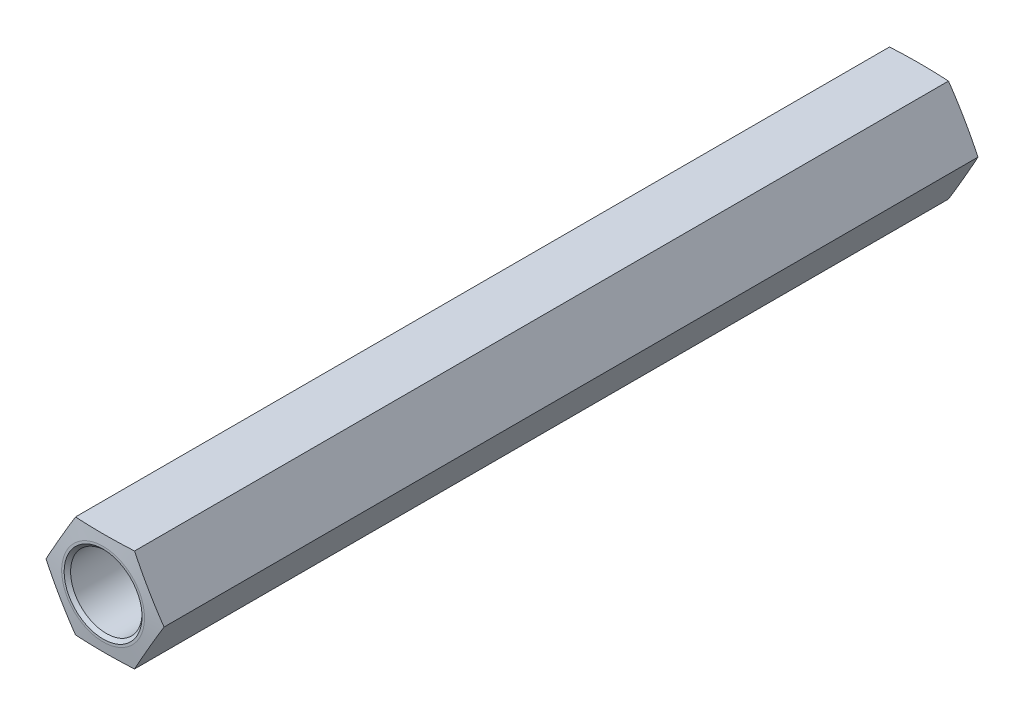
ISO-10303-21;
HEADER;
FILE_DESCRIPTION(('STEP AP214'),'2;1');
FILE_NAME('part.step','',(''),(''),'','','');
FILE_SCHEMA(('AUTOMOTIVE_DESIGN { 1 0 10303 214 1 1 1 1 }'));
ENDSEC;
DATA;
#1=APPLICATION_CONTEXT('core data for automotive mechanical design processes');
#2=APPLICATION_PROTOCOL_DEFINITION('international standard','automotive_design',2000,#1);
#3=PRODUCT_CONTEXT('',#1,'mechanical');
#4=PRODUCT('Part','Part','',(#3));
#5=PRODUCT_RELATED_PRODUCT_CATEGORY('part','',(#4));
#6=PRODUCT_DEFINITION_FORMATION('','',#4);
#7=PRODUCT_DEFINITION_CONTEXT('part definition',#1,'design');
#8=PRODUCT_DEFINITION('design','',#6,#7);
#9=PRODUCT_DEFINITION_SHAPE('','',#8);
#10=(LENGTH_UNIT() NAMED_UNIT(*) SI_UNIT(.MILLI.,.METRE.));
#11=(NAMED_UNIT(*) PLANE_ANGLE_UNIT() SI_UNIT($,.RADIAN.));
#12=(NAMED_UNIT(*) SI_UNIT($,.STERADIAN.) SOLID_ANGLE_UNIT());
#13=UNCERTAINTY_MEASURE_WITH_UNIT(LENGTH_MEASURE(1.E-05),#10,'distance_accuracy_value','');
#14=(GEOMETRIC_REPRESENTATION_CONTEXT(3) GLOBAL_UNCERTAINTY_ASSIGNED_CONTEXT((#13)) GLOBAL_UNIT_ASSIGNED_CONTEXT((#10,
#11,#12)) REPRESENTATION_CONTEXT('',''));
#15=CARTESIAN_POINT('',(0.,0.,0.));
#16=DIRECTION('',(0.,0.,1.));
#17=DIRECTION('',(1.,0.,0.));
#18=AXIS2_PLACEMENT_3D('',#15,#16,#17);
#19=CARTESIAN_POINT('',(3.6427233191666E-08,6.34999999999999,25.4));
#20=DIRECTION('',(0.,0.,-1.));
#21=DIRECTION('',(-1.,0.,0.));
#22=AXIS2_PLACEMENT_3D('',#19,#20,#21);
#23=PLANE('',#22);
#24=CARTESIAN_POINT('',(0.,-6.30938595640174E-08,25.4));
#25=DIRECTION('',(0.,0.,1.));
#26=DIRECTION('',(1.,0.,0.));
#27=AXIS2_PLACEMENT_3D('',#24,#25,#26);
#28=CIRCLE('',#27,2.57273925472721);
#29=CARTESIAN_POINT('',(2.57273925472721,-6.30938595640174E-08,25.4));
#30=VERTEX_POINT('',#29);
#31=EDGE_CURVE('E102',#30,#30,#28,.T.);
#32=ORIENTED_EDGE('',*,*,#31,.T.);
#33=EDGE_LOOP('',(#32));
#34=FACE_BOUND('',#33,.T.);
#35=CARTESIAN_POINT('',(0.,-6.30938595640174E-08,25.4));
#36=DIRECTION('',(0.,0.,-1.));
#37=DIRECTION('',(-1.,0.,0.));
#38=AXIS2_PLACEMENT_3D('',#35,#36,#37);
#39=CIRCLE('',#38,2.42000000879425);
#40=CARTESIAN_POINT('',(-2.42000000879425,-6.30938595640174E-08,25.4));
#41=VERTEX_POINT('',#40);
#42=EDGE_CURVE('E124',#41,#41,#39,.T.);
#43=ORIENTED_EDGE('',*,*,#42,.T.);
#44=EDGE_LOOP('',(#43));
#45=FACE_BOUND('',#44,.T.);
#46=ADVANCED_FACE('F30',(#34,#45),#23,.F.);
#47=CARTESIAN_POINT('',(3.6427233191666E-08,6.34999999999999,-25.4));
#48=DIRECTION('',(0.,0.,-1.));
#49=DIRECTION('',(-1.,0.,0.));
#50=AXIS2_PLACEMENT_3D('',#47,#48,#49);
#51=PLANE('',#50);
#52=CARTESIAN_POINT('',(0.,-6.30938595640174E-08,-25.4));
#53=DIRECTION('',(0.,0.,1.));
#54=DIRECTION('',(1.,0.,0.));
#55=AXIS2_PLACEMENT_3D('',#52,#53,#54);
#56=CIRCLE('',#55,2.57273925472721);
#57=CARTESIAN_POINT('',(2.57273925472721,-6.30938595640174E-08,-25.4));
#58=VERTEX_POINT('',#57);
#59=EDGE_CURVE('E222',#58,#58,#56,.T.);
#60=ORIENTED_EDGE('',*,*,#59,.F.);
#61=EDGE_LOOP('',(#60));
#62=FACE_BOUND('',#61,.T.);
#63=CARTESIAN_POINT('',(0.,-6.30938595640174E-08,-25.4));
#64=DIRECTION('',(0.,0.,-1.));
#65=DIRECTION('',(-1.,0.,0.));
#66=AXIS2_PLACEMENT_3D('',#63,#64,#65);
#67=CIRCLE('',#66,2.42000000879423);
#68=CARTESIAN_POINT('',(-2.42000000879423,-6.30938595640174E-08,-25.4));
#69=VERTEX_POINT('',#68);
#70=EDGE_CURVE('E127',#69,#69,#67,.F.);
#71=ORIENTED_EDGE('',*,*,#70,.T.);
#72=EDGE_LOOP('',(#71));
#73=FACE_BOUND('',#72,.T.);
#74=ADVANCED_FACE('F144',(#62,#73),#51,.T.);
#75=CARTESIAN_POINT('',(-1.83308710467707,3.17499993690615,25.4));
#76=DIRECTION('',(0.866025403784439,-0.5,0.));
#77=DIRECTION('',(0.5,0.866025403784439,0.));
#78=AXIS2_PLACEMENT_3D('',#75,#76,#77);
#79=PLANE('',#78);
#80=DIRECTION('',(0.,0.,-1.));
#81=VECTOR('',#80,1.);
#82=CARTESIAN_POINT('',(-3.66617420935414,-6.30938550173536E-08,25.4));
#83=LINE('',#82,#81);
#84=CARTESIAN_POINT('',(-3.66617420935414,-6.30938550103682E-08,25.28));
#85=VERTEX_POINT('',#84);
#86=CARTESIAN_POINT('',(-3.66617420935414,-6.30938550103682E-08,-25.28));
#87=VERTEX_POINT('',#86);
#88=EDGE_CURVE('E116',#85,#87,#83,.T.);
#89=ORIENTED_EDGE('',*,*,#88,.F.);
#90=CARTESIAN_POINT('',(-3.66628967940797,-0.000200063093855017,25.2799873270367));
#91=CARTESIAN_POINT('',(-3.58994462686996,0.132033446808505,25.2883701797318));
#92=CARTESIAN_POINT('',(-3.51357601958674,0.264307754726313,25.2959650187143));
#93=CARTESIAN_POINT('',(-3.36079345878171,0.528934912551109,25.3092901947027));
#94=CARTESIAN_POINT('',(-3.28437950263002,0.661287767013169,25.3150204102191));
#95=CARTESIAN_POINT('',(-3.13158459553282,0.925936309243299,25.3243226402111));
#96=CARTESIAN_POINT('',(-3.05520367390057,1.05823194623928,25.3278965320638));
#97=CARTESIAN_POINT('',(-2.90242538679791,1.32285170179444,25.3326873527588));
#98=CARTESIAN_POINT('',(-2.82602802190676,1.45517581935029,25.3339043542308));
#99=CARTESIAN_POINT('',(-2.67323329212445,1.719824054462,25.3339043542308));
#100=CARTESIAN_POINT('',(-2.5968359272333,1.85214817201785,25.3326873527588));
#101=CARTESIAN_POINT('',(-2.44405764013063,2.11676792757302,25.3278965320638));
#102=CARTESIAN_POINT('',(-2.36767671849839,2.249063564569,25.3243226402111));
#103=CARTESIAN_POINT('',(-2.21488181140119,2.51371210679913,25.3150204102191));
#104=CARTESIAN_POINT('',(-2.1384678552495,2.64606496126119,25.3092901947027));
#105=CARTESIAN_POINT('',(-1.98568529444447,2.91069211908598,25.2959650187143));
#106=CARTESIAN_POINT('',(-1.90931668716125,3.04296642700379,25.2883701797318));
#107=CARTESIAN_POINT('',(-1.83297163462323,3.17519993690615,25.2799873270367));
#108=B_SPLINE_CURVE_WITH_KNOTS('',3,(#90,#91,#92,#93,#94,#95,#96,#97,#98,#99,#100,#101,#102,
#103,#104,#105,#106,#107),.UNSPECIFIED.,.F.,.F.,(4,2,2,2,2,2,2,2,4),(0.,0.458763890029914,
0.917557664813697,1.37595141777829,1.83433104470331,2.29271067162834,2.75110442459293,
3.20989819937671,3.66866208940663),.UNSPECIFIED.);
#109=CARTESIAN_POINT('',(-1.83308710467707,3.17499993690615,25.28));
#110=VERTEX_POINT('',#109);
#111=EDGE_CURVE('E187',#85,#110,#108,.T.);
#112=ORIENTED_EDGE('',*,*,#111,.T.);
#113=DIRECTION('',(0.,0.,-1.));
#114=VECTOR('',#113,1.);
#115=CARTESIAN_POINT('',(-1.83308710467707,3.17499993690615,25.4));
#116=LINE('',#115,#114);
#117=CARTESIAN_POINT('',(-1.83308710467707,3.17499993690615,-25.28));
#118=VERTEX_POINT('',#117);
#119=EDGE_CURVE('E57',#110,#118,#116,.T.);
#120=ORIENTED_EDGE('',*,*,#119,.T.);
#121=CARTESIAN_POINT('',(-1.83297163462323,3.17519993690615,-25.2799873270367));
#122=CARTESIAN_POINT('',(-1.90931668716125,3.04296642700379,-25.2883701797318));
#123=CARTESIAN_POINT('',(-1.98568529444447,2.91069211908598,-25.2959650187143));
#124=CARTESIAN_POINT('',(-2.1384678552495,2.64606496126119,-25.3092901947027));
#125=CARTESIAN_POINT('',(-2.21488181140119,2.51371210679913,-25.3150204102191));
#126=CARTESIAN_POINT('',(-2.36767671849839,2.249063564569,-25.3243226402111));
#127=CARTESIAN_POINT('',(-2.44405764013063,2.11676792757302,-25.3278965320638));
#128=CARTESIAN_POINT('',(-2.5968359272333,1.85214817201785,-25.3326873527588));
#129=CARTESIAN_POINT('',(-2.67323329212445,1.719824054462,-25.3339043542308));
#130=CARTESIAN_POINT('',(-2.82602802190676,1.45517581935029,-25.3339043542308));
#131=CARTESIAN_POINT('',(-2.90242538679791,1.32285170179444,-25.3326873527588));
#132=CARTESIAN_POINT('',(-3.05520367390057,1.05823194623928,-25.3278965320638));
#133=CARTESIAN_POINT('',(-3.13158459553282,0.925936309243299,-25.3243226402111));
#134=CARTESIAN_POINT('',(-3.28437950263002,0.661287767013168,-25.3150204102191));
#135=CARTESIAN_POINT('',(-3.36079345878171,0.528934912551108,-25.3092901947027));
#136=CARTESIAN_POINT('',(-3.51357601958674,0.264307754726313,-25.2959650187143));
#137=CARTESIAN_POINT('',(-3.58994462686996,0.132033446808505,-25.2883701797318));
#138=CARTESIAN_POINT('',(-3.66628967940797,-0.000200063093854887,-25.2799873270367));
#139=B_SPLINE_CURVE_WITH_KNOTS('',3,(#121,#122,#123,#124,#125,#126,#127,#128,#129,#130,#131,
#132,#133,#134,#135,#136,#137,#138),.UNSPECIFIED.,.F.,.F.,(4,2,2,2,2,2,2,2,4),(0.,
0.458763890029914,0.917557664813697,1.37595141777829,1.83433104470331,2.29271067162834,
2.75110442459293,3.20989819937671,3.66866208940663),.UNSPECIFIED.);
#140=EDGE_CURVE('E209',#118,#87,#139,.T.);
#141=ORIENTED_EDGE('',*,*,#140,.T.);
#142=EDGE_LOOP('',(#89,#112,#120,#141));
#143=FACE_BOUND('',#142,.T.);
#144=ADVANCED_FACE('F196',(#143),#79,.F.);
#145=CARTESIAN_POINT('',(-3.66617420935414,-6.30938550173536E-08,25.4));
#146=DIRECTION('',(0.866025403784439,0.5,0.));
#147=DIRECTION('',(-0.5,0.866025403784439,0.));
#148=AXIS2_PLACEMENT_3D('',#145,#146,#147);
#149=PLANE('',#148);
#150=DIRECTION('',(0.,0.,-1.));
#151=VECTOR('',#150,1.);
#152=CARTESIAN_POINT('',(-1.83308710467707,-3.17500006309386,25.4));
#153=LINE('',#152,#151);
#154=CARTESIAN_POINT('',(-1.83308710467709,-3.17500006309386,25.28));
#155=VERTEX_POINT('',#154);
#156=CARTESIAN_POINT('',(-1.83308710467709,-3.17500006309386,-25.28));
#157=VERTEX_POINT('',#156);
#158=EDGE_CURVE('E110',#155,#157,#153,.T.);
#159=ORIENTED_EDGE('',*,*,#158,.F.);
#160=CARTESIAN_POINT('',(-1.83297163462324,-3.17520006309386,25.2799873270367));
#161=CARTESIAN_POINT('',(-1.90931668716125,-3.0429665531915,25.2883701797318));
#162=CARTESIAN_POINT('',(-1.98568529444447,-2.91069224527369,25.2959650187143));
#163=CARTESIAN_POINT('',(-2.1384678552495,-2.6460650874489,25.3092901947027));
#164=CARTESIAN_POINT('',(-2.21488181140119,-2.51371223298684,25.3150204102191));
#165=CARTESIAN_POINT('',(-2.36767671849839,-2.24906369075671,25.3243226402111));
#166=CARTESIAN_POINT('',(-2.44405764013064,-2.11676805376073,25.3278965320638));
#167=CARTESIAN_POINT('',(-2.5968359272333,-1.85214829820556,25.3326873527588));
#168=CARTESIAN_POINT('',(-2.67323329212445,-1.71982418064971,25.3339043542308));
#169=CARTESIAN_POINT('',(-2.82602802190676,-1.455175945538,25.3339043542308));
#170=CARTESIAN_POINT('',(-2.90242538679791,-1.32285182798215,25.3326873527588));
#171=CARTESIAN_POINT('',(-3.05520367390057,-1.05823207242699,25.3278965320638));
#172=CARTESIAN_POINT('',(-3.13158459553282,-0.925936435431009,25.3243226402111));
#173=CARTESIAN_POINT('',(-3.28437950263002,-0.661287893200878,25.3150204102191));
#174=CARTESIAN_POINT('',(-3.36079345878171,-0.528935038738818,25.3092901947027));
#175=CARTESIAN_POINT('',(-3.51357601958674,-0.264307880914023,25.2959650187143));
#176=CARTESIAN_POINT('',(-3.58994462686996,-0.132033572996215,25.2883701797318));
#177=CARTESIAN_POINT('',(-3.66628967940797,0.000199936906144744,25.2799873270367));
#178=B_SPLINE_CURVE_WITH_KNOTS('',3,(#160,#161,#162,#163,#164,#165,#166,#167,#168,#169,#170,
#171,#172,#173,#174,#175,#176,#177),.UNSPECIFIED.,.F.,.F.,(4,2,2,2,2,2,2,2,4),(0.,
0.458763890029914,0.917557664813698,1.37595141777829,1.83433104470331,2.29271067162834,
2.75110442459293,3.20989819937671,3.66866208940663),.UNSPECIFIED.);
#179=EDGE_CURVE('E181',#155,#85,#178,.T.);
#180=ORIENTED_EDGE('',*,*,#179,.T.);
#181=ORIENTED_EDGE('',*,*,#88,.T.);
#182=CARTESIAN_POINT('',(-3.66628967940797,0.000199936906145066,-25.2799873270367));
#183=CARTESIAN_POINT('',(-3.58994462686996,-0.132033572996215,-25.2883701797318));
#184=CARTESIAN_POINT('',(-3.51357601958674,-0.264307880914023,-25.2959650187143));
#185=CARTESIAN_POINT('',(-3.36079345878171,-0.528935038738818,-25.3092901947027));
#186=CARTESIAN_POINT('',(-3.28437950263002,-0.661287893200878,-25.3150204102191));
#187=CARTESIAN_POINT('',(-3.13158459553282,-0.925936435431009,-25.3243226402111));
#188=CARTESIAN_POINT('',(-3.05520367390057,-1.05823207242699,-25.3278965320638));
#189=CARTESIAN_POINT('',(-2.90242538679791,-1.32285182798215,-25.3326873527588));
#190=CARTESIAN_POINT('',(-2.82602802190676,-1.455175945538,-25.3339043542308));
#191=CARTESIAN_POINT('',(-2.67323329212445,-1.71982418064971,-25.3339043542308));
#192=CARTESIAN_POINT('',(-2.5968359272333,-1.85214829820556,-25.3326873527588));
#193=CARTESIAN_POINT('',(-2.44405764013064,-2.11676805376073,-25.3278965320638));
#194=CARTESIAN_POINT('',(-2.36767671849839,-2.24906369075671,-25.3243226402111));
#195=CARTESIAN_POINT('',(-2.21488181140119,-2.51371223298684,-25.3150204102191));
#196=CARTESIAN_POINT('',(-2.1384678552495,-2.6460650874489,-25.3092901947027));
#197=CARTESIAN_POINT('',(-1.98568529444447,-2.91069224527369,-25.2959650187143));
#198=CARTESIAN_POINT('',(-1.90931668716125,-3.0429665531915,-25.2883701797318));
#199=CARTESIAN_POINT('',(-1.83297163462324,-3.17520006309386,-25.2799873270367));
#200=B_SPLINE_CURVE_WITH_KNOTS('',3,(#182,#183,#184,#185,#186,#187,#188,#189,#190,#191,#192,
#193,#194,#195,#196,#197,#198,#199),.UNSPECIFIED.,.F.,.F.,(4,2,2,2,2,2,2,2,4),(0.,
0.458763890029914,0.917557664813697,1.37595141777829,1.83433104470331,2.29271067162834,
2.75110442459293,3.20989819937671,3.66866208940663),.UNSPECIFIED.);
#201=EDGE_CURVE('E202',#87,#157,#200,.T.);
#202=ORIENTED_EDGE('',*,*,#201,.T.);
#203=EDGE_LOOP('',(#159,#180,#181,#202));
#204=FACE_BOUND('',#203,.T.);
#205=ADVANCED_FACE('F192',(#204),#149,.F.);
#206=CARTESIAN_POINT('',(-1.83308710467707,-3.17500006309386,25.4));
#207=DIRECTION('',(-3.44194550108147E-08,0.999999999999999,0.));
#208=DIRECTION('',(-0.999999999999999,-3.44194550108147E-08,0.));
#209=AXIS2_PLACEMENT_3D('',#206,#207,#208);
#210=PLANE('',#209);
#211=DIRECTION('',(0.,0.,-1.));
#212=VECTOR('',#211,1.);
#213=CARTESIAN_POINT('',(1.83308710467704,-3.17499993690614,25.4));
#214=LINE('',#213,#212);
#215=CARTESIAN_POINT('',(1.83308699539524,-3.17500012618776,25.28));
#216=VERTEX_POINT('',#215);
#217=CARTESIAN_POINT('',(1.83308699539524,-3.17500012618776,-25.28));
#218=VERTEX_POINT('',#217);
#219=EDGE_CURVE('E108',#216,#218,#214,.T.);
#220=ORIENTED_EDGE('',*,*,#219,.F.);
#221=CARTESIAN_POINT('',(-4.83494791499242,-3.17500016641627,25.0475517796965));
#222=CARTESIAN_POINT('',(-4.69083344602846,-3.17500016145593,25.0607700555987));
#223=CARTESIAN_POINT('',(-4.54670317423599,-3.17500015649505,25.0738162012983));
#224=CARTESIAN_POINT('',(-4.25840335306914,-3.17500014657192,25.0994791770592));
#225=CARTESIAN_POINT('',(-4.11423380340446,-3.17500014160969,25.1120960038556));
#226=CARTESIAN_POINT('',(-3.68161123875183,-3.17500012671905,25.1491786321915));
#227=CARTESIAN_POINT('',(-3.39309105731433,-3.17500011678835,25.1728722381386));
#228=CARTESIAN_POINT('',(-2.8161799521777,-3.17500009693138,25.2171363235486));
#229=CARTESIAN_POINT('',(-2.52778933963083,-3.17500008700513,25.2377107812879));
#230=CARTESIAN_POINT('',(-1.95071438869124,-3.17500006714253,25.274212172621));
#231=CARTESIAN_POINT('',(-1.66203005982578,-3.17500005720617,25.2901392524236));
#232=CARTESIAN_POINT('',(-1.08383678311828,-3.17500003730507,25.3153055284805));
#233=CARTESIAN_POINT('',(-0.794327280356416,-3.17500002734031,25.3245328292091));
#234=CARTESIAN_POINT('',(-0.359965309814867,-3.17500001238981,25.3320264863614));
#235=CARTESIAN_POINT('',(-0.215165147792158,-3.17500000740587,25.3334665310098));
#236=CARTESIAN_POINT('',(0.0744404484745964,-3.1749999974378,25.3341710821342));
#237=CARTESIAN_POINT('',(0.219245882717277,-3.17499999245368,25.3334355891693));
#238=CARTESIAN_POINT('',(0.653794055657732,-3.17499997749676,25.3279910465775));
#239=CARTESIAN_POINT('',(0.943499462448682,-3.17499996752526,25.3200410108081));
#240=CARTESIAN_POINT('',(1.52263859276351,-3.17499994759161,25.2970571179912));
#241=CARTESIAN_POINT('',(1.81207228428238,-3.17499993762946,25.2820225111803));
#242=CARTESIAN_POINT('',(2.37658945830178,-3.17499991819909,25.2478298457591));
#243=CARTESIAN_POINT('',(2.65168769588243,-3.17499990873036,25.2289073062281));
#244=CARTESIAN_POINT('',(3.20165867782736,-3.17499988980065,25.1879990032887));
#245=CARTESIAN_POINT('',(3.47653141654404,-3.17499988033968,25.1660131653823));
#246=CARTESIAN_POINT('',(4.02611836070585,-3.1749998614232,25.119972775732));
#247=CARTESIAN_POINT('',(4.30083255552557,-3.17499985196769,25.0959180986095));
#248=CARTESIAN_POINT('',(4.85013324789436,-3.17499983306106,25.0463896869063));
#249=CARTESIAN_POINT('',(5.12471974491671,-3.17499982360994,25.0209159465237));
#250=CARTESIAN_POINT('',(5.67334348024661,-3.17499980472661,24.9690145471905));
#251=CARTESIAN_POINT('',(5.94738087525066,-3.17499979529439,24.9425885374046));
#252=CARTESIAN_POINT('',(6.49538629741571,-3.17499977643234,24.8890190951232));
#253=CARTESIAN_POINT('',(6.76935432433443,-3.17499976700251,24.861875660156));
#254=CARTESIAN_POINT('',(7.31716608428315,-3.17499974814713,24.8070676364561));
#255=CARTESIAN_POINT('',(7.59100983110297,-3.17499973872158,24.7794031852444));
#256=CARTESIAN_POINT('',(8.13865420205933,-3.17499971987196,24.7236676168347));
#257=CARTESIAN_POINT('',(8.41245482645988,-3.17499971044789,24.6955965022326));
#258=CARTESIAN_POINT('',(8.68624054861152,-3.17499970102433,24.6673825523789));
#259=B_SPLINE_CURVE_WITH_KNOTS('',3,(#221,#222,#223,#224,#225,#226,#227,#228,#229,#230,#231,
#232,#233,#234,#235,#236,#237,#238,#239,#240,#241,#242,#243,#244,#245,#246,#247,#248,#249,#250,
#251,#252,#253,#254,#255,#256,#257,#258),.UNSPECIFIED.,.F.,.F.,(4,2,2,2,2,2,2,2,2,2,2,2,2,2,2,2,
2,2,4),(0.,0.434157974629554,0.868319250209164,1.7367826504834,2.60412888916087,
3.47144783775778,4.3403029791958,4.77470987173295,5.20911665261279,6.07843767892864,
6.94785072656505,7.77507130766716,8.60231200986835,9.42960288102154,10.2568971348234,
11.0828216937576,11.9087490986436,12.7344614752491,13.5601685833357),.UNSPECIFIED.);
#260=EDGE_CURVE('E90',#216,#155,#259,.F.);
#261=ORIENTED_EDGE('',*,*,#260,.T.);
#262=ORIENTED_EDGE('',*,*,#158,.T.);
#263=CARTESIAN_POINT('',(-4.83494791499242,-3.17500016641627,-25.0475517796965));
#264=CARTESIAN_POINT('',(-4.69083344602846,-3.17500016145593,-25.0607700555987));
#265=CARTESIAN_POINT('',(-4.54670317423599,-3.17500015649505,-25.0738162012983));
#266=CARTESIAN_POINT('',(-4.25840335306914,-3.17500014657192,-25.0994791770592));
#267=CARTESIAN_POINT('',(-4.11423380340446,-3.17500014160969,-25.1120960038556));
#268=CARTESIAN_POINT('',(-3.68161123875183,-3.17500012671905,-25.1491786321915));
#269=CARTESIAN_POINT('',(-3.39309105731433,-3.17500011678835,-25.1728722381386));
#270=CARTESIAN_POINT('',(-2.8161799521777,-3.17500009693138,-25.2171363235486));
#271=CARTESIAN_POINT('',(-2.52778933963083,-3.17500008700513,-25.2377107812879));
#272=CARTESIAN_POINT('',(-1.95071438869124,-3.17500006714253,-25.274212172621));
#273=CARTESIAN_POINT('',(-1.66203005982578,-3.17500005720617,-25.2901392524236));
#274=CARTESIAN_POINT('',(-1.08383678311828,-3.17500003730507,-25.3153055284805));
#275=CARTESIAN_POINT('',(-0.794327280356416,-3.17500002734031,-25.3245328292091));
#276=CARTESIAN_POINT('',(-0.359965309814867,-3.17500001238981,-25.3320264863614));
#277=CARTESIAN_POINT('',(-0.215165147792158,-3.17500000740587,-25.3334665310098));
#278=CARTESIAN_POINT('',(0.0744404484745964,-3.1749999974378,-25.3341710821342));
#279=CARTESIAN_POINT('',(0.219245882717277,-3.17499999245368,-25.3334355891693));
#280=CARTESIAN_POINT('',(0.653794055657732,-3.17499997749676,-25.3279910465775));
#281=CARTESIAN_POINT('',(0.943499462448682,-3.17499996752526,-25.3200410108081));
#282=CARTESIAN_POINT('',(1.52263859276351,-3.17499994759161,-25.2970571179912));
#283=CARTESIAN_POINT('',(1.81207228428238,-3.17499993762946,-25.2820225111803));
#284=CARTESIAN_POINT('',(2.37658945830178,-3.17499991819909,-25.2478298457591));
#285=CARTESIAN_POINT('',(2.65168769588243,-3.17499990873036,-25.2289073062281));
#286=CARTESIAN_POINT('',(3.20165867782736,-3.17499988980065,-25.1879990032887));
#287=CARTESIAN_POINT('',(3.47653141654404,-3.17499988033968,-25.1660131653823));
#288=CARTESIAN_POINT('',(4.02611836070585,-3.1749998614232,-25.119972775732));
#289=CARTESIAN_POINT('',(4.30083255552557,-3.17499985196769,-25.0959180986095));
#290=CARTESIAN_POINT('',(4.85013324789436,-3.17499983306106,-25.0463896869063));
#291=CARTESIAN_POINT('',(5.12471974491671,-3.17499982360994,-25.0209159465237));
#292=CARTESIAN_POINT('',(5.67334348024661,-3.17499980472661,-24.9690145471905));
#293=CARTESIAN_POINT('',(5.94738087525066,-3.17499979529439,-24.9425885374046));
#294=CARTESIAN_POINT('',(6.49538629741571,-3.17499977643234,-24.8890190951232));
#295=CARTESIAN_POINT('',(6.76935432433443,-3.17499976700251,-24.861875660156));
#296=CARTESIAN_POINT('',(7.31716608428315,-3.17499974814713,-24.8070676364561));
#297=CARTESIAN_POINT('',(7.59100983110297,-3.17499973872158,-24.7794031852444));
#298=CARTESIAN_POINT('',(8.13865420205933,-3.17499971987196,-24.7236676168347));
#299=CARTESIAN_POINT('',(8.41245482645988,-3.17499971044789,-24.6955965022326));
#300=CARTESIAN_POINT('',(8.68624054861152,-3.17499970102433,-24.6673825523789));
#301=B_SPLINE_CURVE_WITH_KNOTS('',3,(#263,#264,#265,#266,#267,#268,#269,#270,#271,#272,#273,
#274,#275,#276,#277,#278,#279,#280,#281,#282,#283,#284,#285,#286,#287,#288,#289,#290,#291,#292,
#293,#294,#295,#296,#297,#298,#299,#300),.UNSPECIFIED.,.F.,.F.,(4,2,2,2,2,2,2,2,2,2,2,2,2,2,2,2,
2,2,4),(0.,0.434157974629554,0.868319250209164,1.7367826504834,2.60412888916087,
3.47144783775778,4.3403029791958,4.77470987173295,5.20911665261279,6.07843767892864,
6.94785072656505,7.77507130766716,8.60231200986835,9.42960288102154,10.2568971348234,
11.0828216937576,11.9087490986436,12.7344614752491,13.5601685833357),.UNSPECIFIED.);
#302=EDGE_CURVE('E210',#157,#218,#301,.T.);
#303=ORIENTED_EDGE('',*,*,#302,.T.);
#304=EDGE_LOOP('',(#220,#261,#262,#303));
#305=FACE_BOUND('',#304,.T.);
#306=ADVANCED_FACE('F195',(#305),#210,.F.);
#307=CARTESIAN_POINT('',(1.83308710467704,-3.17499993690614,25.4));
#308=DIRECTION('',(-0.866025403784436,0.500000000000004,0.));
#309=DIRECTION('',(-0.500000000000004,-0.866025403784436,0.));
#310=AXIS2_PLACEMENT_3D('',#307,#308,#309);
#311=PLANE('',#310);
#312=DIRECTION('',(0.,0.,-1.));
#313=VECTOR('',#312,1.);
#314=CARTESIAN_POINT('',(3.66617420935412,6.3093853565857E-08,25.4));
#315=LINE('',#314,#313);
#316=CARTESIAN_POINT('',(3.66617420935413,6.30938233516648E-08,25.28));
#317=VERTEX_POINT('',#316);
#318=CARTESIAN_POINT('',(3.66617420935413,6.30938233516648E-08,-25.28));
#319=VERTEX_POINT('',#318);
#320=EDGE_CURVE('E99',#317,#319,#315,.T.);
#321=ORIENTED_EDGE('',*,*,#320,.F.);
#322=CARTESIAN_POINT('',(3.66628967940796,0.000200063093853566,25.2799873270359));
#323=CARTESIAN_POINT('',(3.58994462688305,-0.132033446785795,25.2883701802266));
#324=CARTESIAN_POINT('',(3.51357601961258,-0.264307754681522,25.2959650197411));
#325=CARTESIAN_POINT('',(3.36079345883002,-0.528934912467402,25.3092901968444));
#326=CARTESIAN_POINT('',(3.28437950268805,-0.661287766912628,25.3150204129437));
#327=CARTESIAN_POINT('',(3.13158459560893,-0.925936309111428,25.3243226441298));
#328=CARTESIAN_POINT('',(3.05520367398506,-1.0582319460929,25.3278965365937));
#329=CARTESIAN_POINT('',(2.90242538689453,-1.32285170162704,25.3326873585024));
#330=CARTESIAN_POINT('',(2.82602802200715,-1.45517581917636,25.3339043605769));
#331=CARTESIAN_POINT('',(2.67323329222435,-1.71982405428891,25.3339043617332));
#332=CARTESIAN_POINT('',(2.59683592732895,-1.85214817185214,25.3326873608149));
#333=CARTESIAN_POINT('',(2.44405764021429,-2.11676792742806,25.3278965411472));
#334=CARTESIAN_POINT('',(2.36767671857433,-2.24906356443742,25.3243226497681));
#335=CARTESIAN_POINT('',(2.21488181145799,-2.51371210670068,25.3150204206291));
#336=CARTESIAN_POINT('',(2.1384678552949,-2.64606496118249,25.3092902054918));
#337=CARTESIAN_POINT('',(1.9856852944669,-2.91069211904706,25.2959650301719));
#338=CARTESIAN_POINT('',(1.90931668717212,-3.0429664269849,25.2883701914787));
#339=CARTESIAN_POINT('',(1.8329716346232,-3.17519993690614,25.2799873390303));
#340=B_SPLINE_CURVE_WITH_KNOTS('',3,(#322,#323,#324,#325,#326,#327,#328,#329,#330,#331,#332,
#333,#334,#335,#336,#337,#338,#339),.UNSPECIFIED.,.F.,.F.,(4,2,2,2,2,2,2,2,4),(0.,
0.45876389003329,0.917557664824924,1.37595141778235,1.8343310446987,2.29271067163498,
2.75110442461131,3.20989819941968,3.66866208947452),.UNSPECIFIED.);
#341=EDGE_CURVE('E87',#317,#216,#340,.T.);
#342=ORIENTED_EDGE('',*,*,#341,.T.);
#343=ORIENTED_EDGE('',*,*,#219,.T.);
#344=CARTESIAN_POINT('',(1.8329716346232,-3.17519993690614,-25.2799873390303));
#345=CARTESIAN_POINT('',(1.90931668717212,-3.0429664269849,-25.2883701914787));
#346=CARTESIAN_POINT('',(1.9856852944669,-2.91069211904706,-25.2959650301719));
#347=CARTESIAN_POINT('',(2.1384678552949,-2.64606496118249,-25.3092902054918));
#348=CARTESIAN_POINT('',(2.21488181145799,-2.51371210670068,-25.3150204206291));
#349=CARTESIAN_POINT('',(2.36767671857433,-2.24906356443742,-25.3243226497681));
#350=CARTESIAN_POINT('',(2.44405764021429,-2.11676792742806,-25.3278965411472));
#351=CARTESIAN_POINT('',(2.59683592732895,-1.85214817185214,-25.3326873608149));
#352=CARTESIAN_POINT('',(2.67323329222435,-1.71982405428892,-25.3339043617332));
#353=CARTESIAN_POINT('',(2.82602802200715,-1.45517581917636,-25.3339043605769));
#354=CARTESIAN_POINT('',(2.90242538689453,-1.32285170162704,-25.3326873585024));
#355=CARTESIAN_POINT('',(3.05520367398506,-1.0582319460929,-25.3278965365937));
#356=CARTESIAN_POINT('',(3.13158459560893,-0.925936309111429,-25.3243226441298));
#357=CARTESIAN_POINT('',(3.28437950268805,-0.661287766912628,-25.3150204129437));
#358=CARTESIAN_POINT('',(3.36079345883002,-0.528934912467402,-25.3092901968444));
#359=CARTESIAN_POINT('',(3.51357601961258,-0.264307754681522,-25.2959650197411));
#360=CARTESIAN_POINT('',(3.58994462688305,-0.132033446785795,-25.2883701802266));
#361=CARTESIAN_POINT('',(3.66628967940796,0.000200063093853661,-25.2799873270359));
#362=B_SPLINE_CURVE_WITH_KNOTS('',3,(#344,#345,#346,#347,#348,#349,#350,#351,#352,#353,#354,
#355,#356,#357,#358,#359,#360,#361),.UNSPECIFIED.,.F.,.F.,(4,2,2,2,2,2,2,2,4),(0.,
0.458763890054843,0.917557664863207,1.37595141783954,1.83433104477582,2.29271067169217,
2.7511044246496,3.20989819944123,3.66866208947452),.UNSPECIFIED.);
#363=EDGE_CURVE('E107',#218,#319,#362,.T.);
#364=ORIENTED_EDGE('',*,*,#363,.T.);
#365=EDGE_LOOP('',(#321,#342,#343,#364));
#366=FACE_BOUND('',#365,.T.);
#367=ADVANCED_FACE('F105',(#366),#311,.F.);
#368=CARTESIAN_POINT('',(3.66617420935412,6.3093853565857E-08,25.4));
#369=DIRECTION('',(-0.866025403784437,-0.500000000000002,0.));
#370=DIRECTION('',(0.500000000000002,-0.866025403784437,0.));
#371=AXIS2_PLACEMENT_3D('',#368,#369,#370);
#372=PLANE('',#371);
#373=DIRECTION('',(0.,0.,-1.));
#374=VECTOR('',#373,1.);
#375=CARTESIAN_POINT('',(1.83308710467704,3.17500006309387,25.4));
#376=LINE('',#375,#374);
#377=CARTESIAN_POINT('',(1.83308710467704,3.17500006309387,25.2799999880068));
#378=VERTEX_POINT('',#377);
#379=CARTESIAN_POINT('',(1.83308688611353,3.17500006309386,-25.28));
#380=VERTEX_POINT('',#379);
#381=EDGE_CURVE('E101',#378,#380,#376,.T.);
#382=ORIENTED_EDGE('',*,*,#381,.F.);
#383=CARTESIAN_POINT('',(1.8329716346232,3.17520006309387,25.2799873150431));
#384=CARTESIAN_POINT('',(1.90931668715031,3.04296655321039,25.2883701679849));
#385=CARTESIAN_POINT('',(1.98568529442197,2.91069224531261,25.2959650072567));
#386=CARTESIAN_POINT('',(2.13846785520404,2.64606508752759,25.3092901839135));
#387=CARTESIAN_POINT('',(2.21488181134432,2.51371223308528,25.3150203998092));
#388=CARTESIAN_POINT('',(2.3676767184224,2.24906369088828,25.3243226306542));
#389=CARTESIAN_POINT('',(2.44405764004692,2.11676805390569,25.3278965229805));
#390=CARTESIAN_POINT('',(2.5968359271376,1.85214829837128,25.3326873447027));
#391=CARTESIAN_POINT('',(2.6732332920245,1.71982418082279,25.3339043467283));
#392=CARTESIAN_POINT('',(2.82602802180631,1.45517594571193,25.3339043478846));
#393=CARTESIAN_POINT('',(2.90242538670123,1.32285182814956,25.3326873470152));
#394=CARTESIAN_POINT('',(3.05520367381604,1.05823207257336,25.327896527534));
#395=CARTESIAN_POINT('',(3.13158459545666,0.925936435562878,25.3243226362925));
#396=CARTESIAN_POINT('',(3.28437950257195,0.661287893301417,25.3150204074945));
#397=CARTESIAN_POINT('',(3.36079345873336,0.528935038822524,25.309290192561));
#398=CARTESIAN_POINT('',(3.51357601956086,0.264307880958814,25.2959650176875));
#399=CARTESIAN_POINT('',(3.58994462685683,0.132033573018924,25.2883701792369));
#400=CARTESIAN_POINT('',(3.66628967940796,-0.000199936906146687,25.2799873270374));
#401=B_SPLINE_CURVE_WITH_KNOTS('',3,(#383,#384,#385,#386,#387,#388,#389,#390,#391,#392,#393,
#394,#395,#396,#397,#398,#399,#400),.UNSPECIFIED.,.F.,.F.,(4,2,2,2,2,2,2,2,4),(0.,
0.458763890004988,0.917557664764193,1.37595141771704,1.83433104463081,2.29271067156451,
2.75110442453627,3.20989819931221,3.66866208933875),.UNSPECIFIED.);
#402=EDGE_CURVE('E50',#378,#317,#401,.T.);
#403=ORIENTED_EDGE('',*,*,#402,.T.);
#404=ORIENTED_EDGE('',*,*,#320,.T.);
#405=CARTESIAN_POINT('',(3.66628967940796,-0.000199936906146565,-25.2799873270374));
#406=CARTESIAN_POINT('',(3.58994462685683,0.132033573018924,-25.2883701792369));
#407=CARTESIAN_POINT('',(3.51357601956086,0.264307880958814,-25.2959650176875));
#408=CARTESIAN_POINT('',(3.36079345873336,0.528935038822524,-25.309290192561));
#409=CARTESIAN_POINT('',(3.28437950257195,0.661287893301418,-25.3150204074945));
#410=CARTESIAN_POINT('',(3.13158459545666,0.925936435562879,-25.3243226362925));
#411=CARTESIAN_POINT('',(3.05520367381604,1.05823207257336,-25.327896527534));
#412=CARTESIAN_POINT('',(2.90242538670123,1.32285182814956,-25.3326873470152));
#413=CARTESIAN_POINT('',(2.82602802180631,1.45517594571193,-25.3339043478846));
#414=CARTESIAN_POINT('',(2.6732332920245,1.71982418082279,-25.3339043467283));
#415=CARTESIAN_POINT('',(2.5968359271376,1.85214829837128,-25.3326873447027));
#416=CARTESIAN_POINT('',(2.44405764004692,2.11676805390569,-25.3278965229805));
#417=CARTESIAN_POINT('',(2.3676767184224,2.24906369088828,-25.3243226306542));
#418=CARTESIAN_POINT('',(2.21488181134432,2.51371223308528,-25.3150203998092));
#419=CARTESIAN_POINT('',(2.13846785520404,2.64606508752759,-25.3092901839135));
#420=CARTESIAN_POINT('',(1.98568529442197,2.91069224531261,-25.2959650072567));
#421=CARTESIAN_POINT('',(1.90931668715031,3.04296655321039,-25.2883701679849));
#422=CARTESIAN_POINT('',(1.8329716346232,3.17520006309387,-25.2799873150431));
#423=B_SPLINE_CURVE_WITH_KNOTS('',3,(#405,#406,#407,#408,#409,#410,#411,#412,#413,#414,#415,
#416,#417,#418,#419,#420,#421,#422),.UNSPECIFIED.,.F.,.F.,(4,2,2,2,2,2,2,2,4),(0.,
0.45876389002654,0.917557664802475,1.37595141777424,1.83433104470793,2.2927106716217,
2.75110442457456,3.20989819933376,3.66866208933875),.UNSPECIFIED.);
#424=EDGE_CURVE('E154',#319,#380,#423,.T.);
#425=ORIENTED_EDGE('',*,*,#424,.T.);
#426=EDGE_LOOP('',(#382,#403,#404,#425));
#427=FACE_BOUND('',#426,.T.);
#428=ADVANCED_FACE('F97',(#427),#372,.F.);
#429=CARTESIAN_POINT('',(1.83308710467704,3.17500006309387,25.4));
#430=DIRECTION('',(3.44194550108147E-08,-0.999999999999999,0.));
#431=DIRECTION('',(1.,3.44194550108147E-08,0.));
#432=AXIS2_PLACEMENT_3D('',#429,#430,#431);
#433=PLANE('',#432);
#434=ORIENTED_EDGE('',*,*,#119,.F.);
#435=CARTESIAN_POINT('',(-4.83495216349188,3.17499983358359,25.0475514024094));
#436=CARTESIAN_POINT('',(-4.69083751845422,3.17499983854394,25.0607696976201));
#437=CARTESIAN_POINT('',(-4.54670707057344,3.17499984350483,25.0738158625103));
#438=CARTESIAN_POINT('',(-4.25840689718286,3.17499985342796,25.099478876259));
#439=CARTESIAN_POINT('',(-4.11423717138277,3.17499985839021,25.1120957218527));
#440=CARTESIAN_POINT('',(-3.68161407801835,3.17499987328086,25.1491784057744));
#441=CARTESIAN_POINT('',(-3.3930935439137,3.17499988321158,25.1728720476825));
#442=CARTESIAN_POINT('',(-2.81618173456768,3.17499990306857,25.2171362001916));
#443=CARTESIAN_POINT('',(-2.52779077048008,3.17499991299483,25.2377106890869));
#444=CARTESIAN_POINT('',(-1.95071511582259,3.17499993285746,25.2742121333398));
#445=CARTESIAN_POINT('',(-1.66203043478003,3.17499994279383,25.2901392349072));
#446=CARTESIAN_POINT('',(-1.08383644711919,3.17499996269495,25.3153055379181));
#447=CARTESIAN_POINT('',(-0.79432658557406,3.17499997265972,25.3245328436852));
#448=CARTESIAN_POINT('',(-0.359964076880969,3.17499998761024,25.3320264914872));
#449=CARTESIAN_POINT('',(-0.215163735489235,3.17499999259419,25.3334665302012));
#450=CARTESIAN_POINT('',(0.0744422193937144,3.17500000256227,25.3341710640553));
#451=CARTESIAN_POINT('',(0.219247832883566,3.1750000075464,25.3334355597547));
#452=CARTESIAN_POINT('',(0.653796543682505,3.17500002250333,25.3279909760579));
#453=CARTESIAN_POINT('',(0.943502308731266,3.17500003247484,25.3200409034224));
#454=CARTESIAN_POINT('',(1.52264215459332,3.17500005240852,25.2970569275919));
#455=CARTESIAN_POINT('',(1.81207620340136,3.17500006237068,25.2820222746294));
#456=CARTESIAN_POINT('',(2.37659373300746,3.17500008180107,25.2478295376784));
#457=CARTESIAN_POINT('',(2.65169196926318,3.1750000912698,25.2289069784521));
#458=CARTESIAN_POINT('',(3.20166294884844,3.1750001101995,25.1879986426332));
#459=CARTESIAN_POINT('',(3.47653568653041,3.17500011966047,25.1660127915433));
#460=CARTESIAN_POINT('',(4.02612262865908,3.17500013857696,25.1199723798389));
#461=CARTESIAN_POINT('',(4.30083682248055,3.17500014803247,25.0959176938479));
#462=CARTESIAN_POINT('',(4.85013751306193,3.1750001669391,25.0463892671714));
#463=CARTESIAN_POINT('',(5.12472400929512,3.17500017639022,25.020915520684));
#464=CARTESIAN_POINT('',(5.6733477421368,3.17500019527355,24.9690141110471));
#465=CARTESIAN_POINT('',(5.94738513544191,3.17500020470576,24.9425880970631));
#466=CARTESIAN_POINT('',(6.49539055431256,3.17500022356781,24.8890186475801));
#467=CARTESIAN_POINT('',(6.76935857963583,3.17500023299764,24.8618752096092));
#468=CARTESIAN_POINT('',(7.31717033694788,3.17500025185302,24.807067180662));
#469=CARTESIAN_POINT('',(7.59101408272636,3.17500026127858,24.7794027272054));
#470=CARTESIAN_POINT('',(8.13865845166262,3.1750002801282,24.7236671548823));
#471=CARTESIAN_POINT('',(8.4124590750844,3.17500028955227,24.6955960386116));
#472=CARTESIAN_POINT('',(8.68624479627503,3.17500029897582,24.667382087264));
#473=B_SPLINE_CURVE_WITH_KNOTS('',3,(#435,#436,#437,#438,#439,#440,#441,#442,#443,#444,#445,
#446,#447,#448,#449,#450,#451,#452,#453,#454,#455,#456,#457,#458,#459,#460,#461,#462,#463,#464,
#465,#466,#467,#468,#469,#470,#471,#472),.UNSPECIFIED.,.F.,.F.,(4,2,2,2,2,2,2,2,2,2,2,2,2,2,2,2,
2,2,4),(0.,0.434158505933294,0.868320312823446,1.73678477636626,2.60413207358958,
3.47145208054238,4.34030829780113,4.77471572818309,5.20912304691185,6.07844515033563,
6.94785927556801,7.77507985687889,8.60232055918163,9.42961142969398,10.2569056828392,
11.0828302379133,11.9087576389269,12.734470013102,13.5601771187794),.UNSPECIFIED.);
#474=EDGE_CURVE('E11',#110,#378,#473,.T.);
#475=ORIENTED_EDGE('',*,*,#474,.T.);
#476=ORIENTED_EDGE('',*,*,#381,.T.);
#477=CARTESIAN_POINT('',(-4.83495216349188,3.17499983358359,-25.0475514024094));
#478=CARTESIAN_POINT('',(-4.69083751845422,3.17499983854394,-25.0607696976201));
#479=CARTESIAN_POINT('',(-4.54670707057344,3.17499984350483,-25.0738158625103));
#480=CARTESIAN_POINT('',(-4.25840689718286,3.17499985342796,-25.099478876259));
#481=CARTESIAN_POINT('',(-4.11423717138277,3.17499985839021,-25.1120957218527));
#482=CARTESIAN_POINT('',(-3.68161407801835,3.17499987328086,-25.1491784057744));
#483=CARTESIAN_POINT('',(-3.3930935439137,3.17499988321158,-25.1728720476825));
#484=CARTESIAN_POINT('',(-2.81618173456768,3.17499990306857,-25.2171362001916));
#485=CARTESIAN_POINT('',(-2.52779077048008,3.17499991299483,-25.2377106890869));
#486=CARTESIAN_POINT('',(-1.95071511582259,3.17499993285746,-25.2742121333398));
#487=CARTESIAN_POINT('',(-1.66203043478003,3.17499994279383,-25.2901392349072));
#488=CARTESIAN_POINT('',(-1.08383644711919,3.17499996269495,-25.3153055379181));
#489=CARTESIAN_POINT('',(-0.79432658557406,3.17499997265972,-25.3245328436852));
#490=CARTESIAN_POINT('',(-0.359964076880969,3.17499998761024,-25.3320264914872));
#491=CARTESIAN_POINT('',(-0.215163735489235,3.17499999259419,-25.3334665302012));
#492=CARTESIAN_POINT('',(0.0744422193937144,3.17500000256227,-25.3341710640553));
#493=CARTESIAN_POINT('',(0.219247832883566,3.1750000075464,-25.3334355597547));
#494=CARTESIAN_POINT('',(0.653796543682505,3.17500002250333,-25.3279909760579));
#495=CARTESIAN_POINT('',(0.943502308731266,3.17500003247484,-25.3200409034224));
#496=CARTESIAN_POINT('',(1.52264215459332,3.17500005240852,-25.2970569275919));
#497=CARTESIAN_POINT('',(1.81207620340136,3.17500006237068,-25.2820222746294));
#498=CARTESIAN_POINT('',(2.37659373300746,3.17500008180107,-25.2478295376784));
#499=CARTESIAN_POINT('',(2.65169196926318,3.1750000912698,-25.2289069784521));
#500=CARTESIAN_POINT('',(3.20166294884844,3.1750001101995,-25.1879986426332));
#501=CARTESIAN_POINT('',(3.47653568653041,3.17500011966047,-25.1660127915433));
#502=CARTESIAN_POINT('',(4.02612262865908,3.17500013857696,-25.1199723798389));
#503=CARTESIAN_POINT('',(4.30083682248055,3.17500014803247,-25.0959176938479));
#504=CARTESIAN_POINT('',(4.85013751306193,3.1750001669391,-25.0463892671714));
#505=CARTESIAN_POINT('',(5.12472400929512,3.17500017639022,-25.020915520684));
#506=CARTESIAN_POINT('',(5.6733477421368,3.17500019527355,-24.9690141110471));
#507=CARTESIAN_POINT('',(5.94738513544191,3.17500020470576,-24.9425880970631));
#508=CARTESIAN_POINT('',(6.49539055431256,3.17500022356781,-24.8890186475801));
#509=CARTESIAN_POINT('',(6.76935857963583,3.17500023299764,-24.8618752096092));
#510=CARTESIAN_POINT('',(7.31717033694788,3.17500025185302,-24.807067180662));
#511=CARTESIAN_POINT('',(7.59101408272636,3.17500026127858,-24.7794027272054));
#512=CARTESIAN_POINT('',(8.13865845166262,3.1750002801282,-24.7236671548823));
#513=CARTESIAN_POINT('',(8.4124590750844,3.17500028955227,-24.6955960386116));
#514=CARTESIAN_POINT('',(8.68624479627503,3.17500029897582,-24.667382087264));
#515=B_SPLINE_CURVE_WITH_KNOTS('',3,(#477,#478,#479,#480,#481,#482,#483,#484,#485,#486,#487,
#488,#489,#490,#491,#492,#493,#494,#495,#496,#497,#498,#499,#500,#501,#502,#503,#504,#505,#506,
#507,#508,#509,#510,#511,#512,#513,#514),.UNSPECIFIED.,.F.,.F.,(4,2,2,2,2,2,2,2,2,2,2,2,2,2,2,2,
2,2,4),(0.,0.434158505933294,0.868320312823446,1.73678477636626,2.60413207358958,
3.47145208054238,4.34030829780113,4.77471572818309,5.20912304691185,6.07844515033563,
6.94785927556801,7.77507985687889,8.60232055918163,9.42961142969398,10.2569056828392,
11.0828302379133,11.9087576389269,12.734470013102,13.5601771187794),.UNSPECIFIED.);
#516=EDGE_CURVE('E43',#380,#118,#515,.F.);
#517=ORIENTED_EDGE('',*,*,#516,.T.);
#518=EDGE_LOOP('',(#434,#475,#476,#517));
#519=FACE_BOUND('',#518,.T.);
#520=ADVANCED_FACE('F137',(#519),#433,.F.);
#521=CARTESIAN_POINT('',(0.,-6.30938595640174E-08,25.4));
#522=DIRECTION('',(0.,0.,-1.));
#523=DIRECTION('',(-1.,0.,0.));
#524=AXIS2_PLACEMENT_3D('',#521,#522,#523);
#525=CYLINDRICAL_SURFACE('',#524,2.22000000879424);
#526=CARTESIAN_POINT('',(0.,-6.30938595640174E-08,25.2));
#527=DIRECTION('',(0.,0.,-1.));
#528=DIRECTION('',(-1.,0.,0.));
#529=AXIS2_PLACEMENT_3D('',#526,#527,#528);
#530=CIRCLE('',#529,2.22000000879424);
#531=CARTESIAN_POINT('',(-2.22000000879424,-6.30938595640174E-08,25.2));
#532=VERTEX_POINT('',#531);
#533=EDGE_CURVE('E121',#532,#532,#530,.F.);
#534=ORIENTED_EDGE('',*,*,#533,.T.);
#535=EDGE_LOOP('',(#534));
#536=FACE_BOUND('',#535,.T.);
#537=CARTESIAN_POINT('',(0.,-6.30938595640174E-08,-25.2));
#538=DIRECTION('',(0.,0.,-1.));
#539=DIRECTION('',(-1.,0.,0.));
#540=AXIS2_PLACEMENT_3D('',#537,#538,#539);
#541=CIRCLE('',#540,2.22000000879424);
#542=CARTESIAN_POINT('',(-2.22000000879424,-6.30938595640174E-08,-25.2));
#543=VERTEX_POINT('',#542);
#544=EDGE_CURVE('E118',#543,#543,#541,.T.);
#545=ORIENTED_EDGE('',*,*,#544,.T.);
#546=EDGE_LOOP('',(#545));
#547=FACE_BOUND('',#546,.T.);
#548=ADVANCED_FACE('F142',(#536,#547),#525,.F.);
#549=CARTESIAN_POINT('',(0.,-6.30938595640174E-08,25.2));
#550=DIRECTION('',(0.,0.,1.));
#551=DIRECTION('',(1.,0.,0.));
#552=AXIS2_PLACEMENT_3D('',#549,#550,#551);
#553=CONICAL_SURFACE('',#552,2.22000000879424,0.785398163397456);
#554=ORIENTED_EDGE('',*,*,#42,.F.);
#555=EDGE_LOOP('',(#554));
#556=FACE_BOUND('',#555,.T.);
#557=ORIENTED_EDGE('',*,*,#533,.F.);
#558=EDGE_LOOP('',(#557));
#559=FACE_BOUND('',#558,.T.);
#560=ADVANCED_FACE('F245',(#556,#559),#553,.F.);
#561=CARTESIAN_POINT('',(0.,-6.30938595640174E-08,-25.4));
#562=DIRECTION('',(0.,0.,-1.));
#563=DIRECTION('',(-1.,0.,0.));
#564=AXIS2_PLACEMENT_3D('',#561,#562,#563);
#565=CONICAL_SURFACE('',#564,2.42000000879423,0.785398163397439);
#566=ORIENTED_EDGE('',*,*,#544,.F.);
#567=EDGE_LOOP('',(#566));
#568=FACE_BOUND('',#567,.T.);
#569=ORIENTED_EDGE('',*,*,#70,.F.);
#570=EDGE_LOOP('',(#569));
#571=FACE_BOUND('',#570,.T.);
#572=ADVANCED_FACE('F32',(#568,#571),#565,.F.);
#573=CARTESIAN_POINT('',(0.,-6.30938595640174E-08,-25.4));
#574=DIRECTION('',(0.,0.,1.));
#575=DIRECTION('',(1.,0.,0.));
#576=AXIS2_PLACEMENT_3D('',#573,#574,#575);
#577=CONICAL_SURFACE('',#576,2.57273925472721,1.46148787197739);
#578=ORIENTED_EDGE('',*,*,#59,.T.);
#579=EDGE_LOOP('',(#578));
#580=FACE_BOUND('',#579,.T.);
#581=ORIENTED_EDGE('',*,*,#516,.F.);
#582=ORIENTED_EDGE('',*,*,#424,.F.);
#583=ORIENTED_EDGE('',*,*,#363,.F.);
#584=ORIENTED_EDGE('',*,*,#302,.F.);
#585=ORIENTED_EDGE('',*,*,#201,.F.);
#586=ORIENTED_EDGE('',*,*,#140,.F.);
#587=EDGE_LOOP('',(#581,#582,#583,#584,#585,#586));
#588=FACE_BOUND('',#587,.T.);
#589=ADVANCED_FACE('F134',(#580,#588),#577,.T.);
#590=CARTESIAN_POINT('',(0.,-6.30938595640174E-08,25.4));
#591=DIRECTION('',(0.,0.,-1.));
#592=DIRECTION('',(1.,0.,0.));
#593=AXIS2_PLACEMENT_3D('',#590,#591,#592);
#594=CONICAL_SURFACE('',#593,2.57273925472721,1.46148787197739);
#595=ORIENTED_EDGE('',*,*,#31,.F.);
#596=EDGE_LOOP('',(#595));
#597=FACE_BOUND('',#596,.T.);
#598=ORIENTED_EDGE('',*,*,#179,.F.);
#599=ORIENTED_EDGE('',*,*,#260,.F.);
#600=ORIENTED_EDGE('',*,*,#341,.F.);
#601=ORIENTED_EDGE('',*,*,#402,.F.);
#602=ORIENTED_EDGE('',*,*,#474,.F.);
#603=ORIENTED_EDGE('',*,*,#111,.F.);
#604=EDGE_LOOP('',(#598,#599,#600,#601,#602,#603));
#605=FACE_BOUND('',#604,.T.);
#606=ADVANCED_FACE('F88',(#597,#605),#594,.T.);
#607=CLOSED_SHELL('',(#46,#74,#144,#205,#306,#367,#428,#520,#548,#560,#572,#589,#606));
#608=MANIFOLD_SOLID_BREP('B2',#607);
#609=ADVANCED_BREP_SHAPE_REPRESENTATION('',(#18,#608),#14);
#610=SHAPE_DEFINITION_REPRESENTATION(#9,#609);
ENDSEC;
END-ISO-10303-21;
